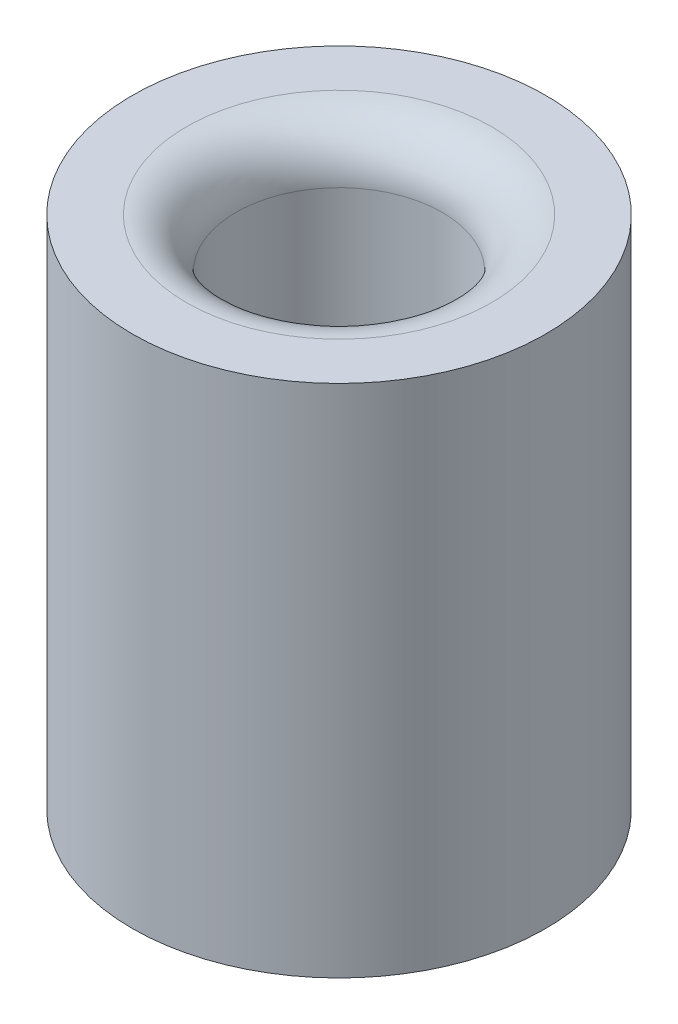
ISO-10303-21;
HEADER;
FILE_DESCRIPTION(('STEP AP214'),'2;1');
FILE_NAME('part.step','',(''),(''),'','','');
FILE_SCHEMA(('AUTOMOTIVE_DESIGN { 1 0 10303 214 1 1 1 1 }'));
ENDSEC;
DATA;
#1=APPLICATION_CONTEXT('core data for automotive mechanical design processes');
#2=APPLICATION_PROTOCOL_DEFINITION('international standard','automotive_design',2000,#1);
#3=PRODUCT_CONTEXT('',#1,'mechanical');
#4=PRODUCT('Part','Part','',(#3));
#5=PRODUCT_RELATED_PRODUCT_CATEGORY('part','',(#4));
#6=PRODUCT_DEFINITION_FORMATION('','',#4);
#7=PRODUCT_DEFINITION_CONTEXT('part definition',#1,'design');
#8=PRODUCT_DEFINITION('design','',#6,#7);
#9=PRODUCT_DEFINITION_SHAPE('','',#8);
#10=(LENGTH_UNIT() NAMED_UNIT(*) SI_UNIT(.MILLI.,.METRE.));
#11=(NAMED_UNIT(*) PLANE_ANGLE_UNIT() SI_UNIT($,.RADIAN.));
#12=(NAMED_UNIT(*) SI_UNIT($,.STERADIAN.) SOLID_ANGLE_UNIT());
#13=UNCERTAINTY_MEASURE_WITH_UNIT(LENGTH_MEASURE(1.E-05),#10,'distance_accuracy_value','');
#14=(GEOMETRIC_REPRESENTATION_CONTEXT(3) GLOBAL_UNCERTAINTY_ASSIGNED_CONTEXT((#13)) GLOBAL_UNIT_ASSIGNED_CONTEXT((#10,
#11,#12)) REPRESENTATION_CONTEXT('',''));
#15=CARTESIAN_POINT('',(0.,0.,0.));
#16=DIRECTION('',(0.,0.,1.));
#17=DIRECTION('',(1.,0.,0.));
#18=AXIS2_PLACEMENT_3D('',#15,#16,#17);
#19=CARTESIAN_POINT('',(0.,0.,-1.58877));
#20=DIRECTION('',(0.,-1.,0.));
#21=DIRECTION('',(0.,0.,-1.));
#22=AXIS2_PLACEMENT_3D('',#19,#20,#21);
#23=PLANE('',#22);
#24=CARTESIAN_POINT('',(0.,0.,0.));
#25=DIRECTION('',(0.,-1.,0.));
#26=DIRECTION('',(0.,0.,-1.));
#27=AXIS2_PLACEMENT_3D('',#24,#25,#26);
#28=CIRCLE('',#27,2.35077);
#29=CARTESIAN_POINT('',(0.,0.,-2.35077));
#30=VERTEX_POINT('',#29);
#31=EDGE_CURVE('E10',#30,#30,#28,.T.);
#32=ORIENTED_EDGE('',*,*,#31,.T.);
#33=EDGE_LOOP('',(#32));
#34=FACE_BOUND('',#33,.T.);
#35=CARTESIAN_POINT('',(0.,0.,0.));
#36=DIRECTION('',(0.,1.,0.));
#37=DIRECTION('',(0.,0.,1.));
#38=AXIS2_PLACEMENT_3D('',#35,#36,#37);
#39=CIRCLE('',#38,3.18643);
#40=CARTESIAN_POINT('',(0.,0.,3.18643));
#41=VERTEX_POINT('',#40);
#42=EDGE_CURVE('E47',#41,#41,#39,.T.);
#43=ORIENTED_EDGE('',*,*,#42,.T.);
#44=EDGE_LOOP('',(#43));
#45=FACE_BOUND('',#44,.T.);
#46=ADVANCED_FACE('F28',(#34,#45),#23,.F.);
#47=CARTESIAN_POINT('',(0.,0.,0.));
#48=DIRECTION('',(0.,1.,0.));
#49=DIRECTION('',(0.,0.,1.));
#50=AXIS2_PLACEMENT_3D('',#47,#48,#49);
#51=CYLINDRICAL_SURFACE('',#50,1.58877);
#52=CARTESIAN_POINT('',(0.,-0.762,0.));
#53=DIRECTION('',(0.,-1.,0.));
#54=DIRECTION('',(0.,0.,-1.));
#55=AXIS2_PLACEMENT_3D('',#52,#53,#54);
#56=CIRCLE('',#55,1.58877);
#57=CARTESIAN_POINT('',(0.,-0.762,-1.58877));
#58=VERTEX_POINT('',#57);
#59=EDGE_CURVE('E34',#58,#58,#56,.F.);
#60=ORIENTED_EDGE('',*,*,#59,.T.);
#61=EDGE_LOOP('',(#60));
#62=FACE_BOUND('',#61,.T.);
#63=CARTESIAN_POINT('',(0.,-7.9375,0.));
#64=DIRECTION('',(0.,1.,0.));
#65=DIRECTION('',(0.,0.,1.));
#66=AXIS2_PLACEMENT_3D('',#63,#64,#65);
#67=CIRCLE('',#66,1.58877);
#68=CARTESIAN_POINT('',(0.,-7.9375,1.58877));
#69=VERTEX_POINT('',#68);
#70=EDGE_CURVE('E38',#69,#69,#67,.T.);
#71=ORIENTED_EDGE('',*,*,#70,.F.);
#72=EDGE_LOOP('',(#71));
#73=FACE_BOUND('',#72,.T.);
#74=ADVANCED_FACE('F62',(#62,#73),#51,.F.);
#75=CARTESIAN_POINT('',(0.,-7.9375,-1.58877));
#76=DIRECTION('',(0.,1.,0.));
#77=DIRECTION('',(0.,0.,1.));
#78=AXIS2_PLACEMENT_3D('',#75,#76,#77);
#79=PLANE('',#78);
#80=CARTESIAN_POINT('',(0.,-7.9375,0.));
#81=DIRECTION('',(0.,1.,0.));
#82=DIRECTION('',(0.,0.,1.));
#83=AXIS2_PLACEMENT_3D('',#80,#81,#82);
#84=CIRCLE('',#83,3.18643);
#85=CARTESIAN_POINT('',(0.,-7.9375,3.18643));
#86=VERTEX_POINT('',#85);
#87=EDGE_CURVE('E42',#86,#86,#84,.T.);
#88=ORIENTED_EDGE('',*,*,#87,.F.);
#89=EDGE_LOOP('',(#88));
#90=FACE_BOUND('',#89,.T.);
#91=ORIENTED_EDGE('',*,*,#70,.T.);
#92=EDGE_LOOP('',(#91));
#93=FACE_BOUND('',#92,.T.);
#94=ADVANCED_FACE('F56',(#90,#93),#79,.F.);
#95=CARTESIAN_POINT('',(0.,0.,0.));
#96=DIRECTION('',(0.,1.,0.));
#97=DIRECTION('',(0.,0.,1.));
#98=AXIS2_PLACEMENT_3D('',#95,#96,#97);
#99=CYLINDRICAL_SURFACE('',#98,3.18643);
#100=ORIENTED_EDGE('',*,*,#42,.F.);
#101=EDGE_LOOP('',(#100));
#102=FACE_BOUND('',#101,.T.);
#103=ORIENTED_EDGE('',*,*,#87,.T.);
#104=EDGE_LOOP('',(#103));
#105=FACE_BOUND('',#104,.T.);
#106=ADVANCED_FACE('F52',(#102,#105),#99,.T.);
#107=CARTESIAN_POINT('',(0.,-0.762,0.));
#108=DIRECTION('',(0.,-1.,0.));
#109=DIRECTION('',(0.,0.,-1.));
#110=AXIS2_PLACEMENT_3D('',#107,#108,#109);
#111=TOROIDAL_SURFACE('',#110,2.35077,0.762);
#112=ORIENTED_EDGE('',*,*,#31,.F.);
#113=EDGE_LOOP('',(#112));
#114=FACE_BOUND('',#113,.T.);
#115=ORIENTED_EDGE('',*,*,#59,.F.);
#116=EDGE_LOOP('',(#115));
#117=FACE_BOUND('',#116,.T.);
#118=ADVANCED_FACE('F55',(#114,#117),#111,.T.);
#119=CLOSED_SHELL('',(#46,#74,#94,#106,#118));
#120=MANIFOLD_SOLID_BREP('B2',#119);
#121=ADVANCED_BREP_SHAPE_REPRESENTATION('',(#18,#120),#14);
#122=SHAPE_DEFINITION_REPRESENTATION(#9,#121);
ENDSEC;
END-ISO-10303-21;
